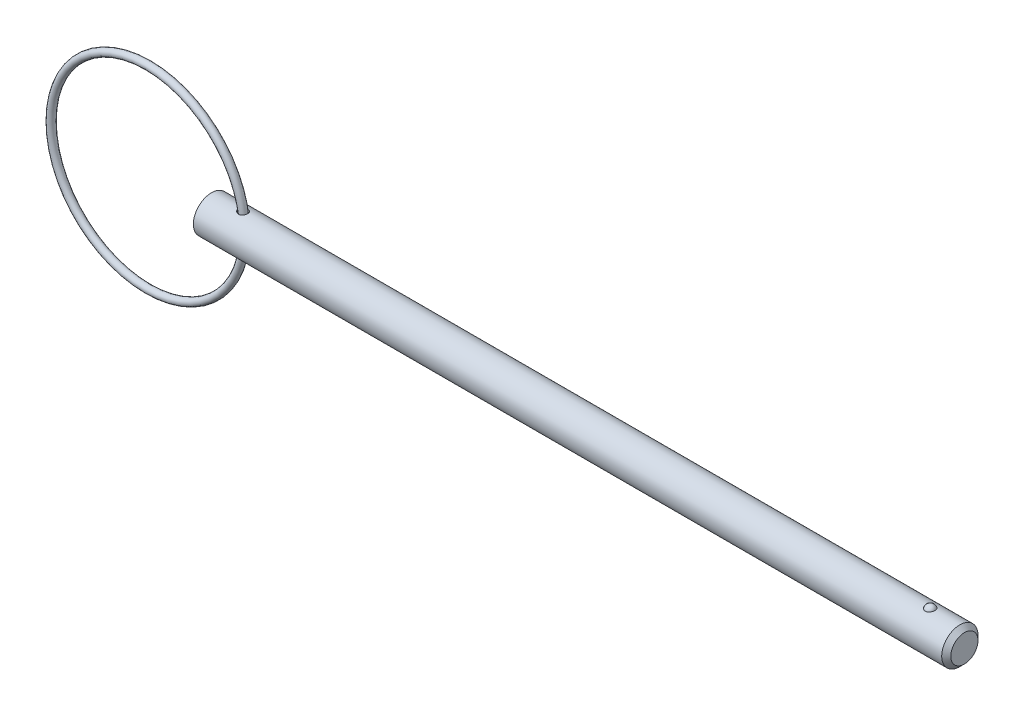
ISO-10303-21;
HEADER;
FILE_DESCRIPTION(('STEP AP214'),'2;1');
FILE_NAME('part.step','',(''),(''),'','','');
FILE_SCHEMA(('AUTOMOTIVE_DESIGN { 1 0 10303 214 1 1 1 1 }'));
ENDSEC;
DATA;
#1=APPLICATION_CONTEXT('core data for automotive mechanical design processes');
#2=APPLICATION_PROTOCOL_DEFINITION('international standard','automotive_design',2000,#1);
#3=PRODUCT_CONTEXT('',#1,'mechanical');
#4=PRODUCT('Part','Part','',(#3));
#5=PRODUCT_RELATED_PRODUCT_CATEGORY('part','',(#4));
#6=PRODUCT_DEFINITION_FORMATION('','',#4);
#7=PRODUCT_DEFINITION_CONTEXT('part definition',#1,'design');
#8=PRODUCT_DEFINITION('design','',#6,#7);
#9=PRODUCT_DEFINITION_SHAPE('','',#8);
#10=(LENGTH_UNIT() NAMED_UNIT(*) SI_UNIT(.MILLI.,.METRE.));
#11=(NAMED_UNIT(*) PLANE_ANGLE_UNIT() SI_UNIT($,.RADIAN.));
#12=(NAMED_UNIT(*) SI_UNIT($,.STERADIAN.) SOLID_ANGLE_UNIT());
#13=UNCERTAINTY_MEASURE_WITH_UNIT(LENGTH_MEASURE(1.E-05),#10,'distance_accuracy_value','');
#14=(GEOMETRIC_REPRESENTATION_CONTEXT(3) GLOBAL_UNCERTAINTY_ASSIGNED_CONTEXT((#13)) GLOBAL_UNIT_ASSIGNED_CONTEXT((#10,
#11,#12)) REPRESENTATION_CONTEXT('',''));
#15=CARTESIAN_POINT('',(0.,0.,0.));
#16=DIRECTION('',(0.,0.,1.));
#17=DIRECTION('',(1.,0.,0.));
#18=AXIS2_PLACEMENT_3D('',#15,#16,#17);
#19=CARTESIAN_POINT('',(-8.3302379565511,0.,0.));
#20=DIRECTION('',(0.,0.,1.));
#21=DIRECTION('',(1.,0.,0.));
#22=AXIS2_PLACEMENT_3D('',#19,#20,#21);
#23=TOROIDAL_SURFACE('',#22,12.7,0.476000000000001);
#24=CARTESIAN_POINT('',(4.8457620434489,0.,0.));
#25=VERTEX_POINT('',#24);
#26=VERTEX_LOOP('',#25);
#27=FACE_BOUND('',#26,.T.);
#28=ADVANCED_FACE('P0_F12',(#27),#23,.T.);
#29=CLOSED_SHELL('',(#28));
#30=MANIFOLD_SOLID_BREP('P0_B1',#29);
#31=CARTESIAN_POINT('',(0.,0.,0.));
#32=DIRECTION('',(1.,0.,0.));
#33=DIRECTION('',(0.,0.,-1.));
#34=AXIS2_PLACEMENT_3D('',#31,#32,#33);
#35=CYLINDRICAL_SURFACE('',#34,2.38);
#36=CARTESIAN_POINT('',(3.67748265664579,2.35074198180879,-0.372037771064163));
#37=CARTESIAN_POINT('',(3.70046616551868,2.34644965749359,-0.399158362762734));
#38=CARTESIAN_POINT('',(3.72581651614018,2.34199234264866,-0.424274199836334));
#39=CARTESIAN_POINT('',(3.78042747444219,2.33326580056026,-0.469907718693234));
#40=CARTESIAN_POINT('',(3.80969342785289,2.32899684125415,-0.490419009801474));
#41=CARTESIAN_POINT('',(3.87128330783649,2.32114904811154,-0.526312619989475));
#42=CARTESIAN_POINT('',(3.90360537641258,2.31756979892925,-0.541698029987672));
#43=CARTESIAN_POINT('',(3.9704452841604,2.31153734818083,-0.566889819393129));
#44=CARTESIAN_POINT('',(4.00496214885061,2.30908365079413,-0.576698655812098));
#45=CARTESIAN_POINT('',(4.07500735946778,2.30564492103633,-0.590297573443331));
#46=CARTESIAN_POINT('',(4.1105275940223,2.30465036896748,-0.594126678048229));
#47=CARTESIAN_POINT('',(4.18170718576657,2.30426876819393,-0.595606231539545));
#48=CARTESIAN_POINT('',(4.21736649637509,2.30488122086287,-0.593258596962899));
#49=CARTESIAN_POINT('',(4.28577822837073,2.30759475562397,-0.582609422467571));
#50=CARTESIAN_POINT('',(4.31858437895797,2.30961492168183,-0.574631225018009));
#51=CARTESIAN_POINT('',(4.38227060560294,2.31483318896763,-0.553233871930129));
#52=CARTESIAN_POINT('',(4.41315097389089,2.31803111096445,-0.539815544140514));
#53=CARTESIAN_POINT('',(4.47118254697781,2.3251225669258,-0.508384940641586));
#54=CARTESIAN_POINT('',(4.49841743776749,2.32899254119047,-0.490521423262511));
#55=CARTESIAN_POINT('',(4.5494826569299,2.33706025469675,-0.450515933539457));
#56=CARTESIAN_POINT('',(4.57331285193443,2.34125800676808,-0.42837379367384));
#57=CARTESIAN_POINT('',(4.6171621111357,2.34956202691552,-0.380209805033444));
#58=CARTESIAN_POINT('',(4.63714543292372,2.35366715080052,-0.354155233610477));
#59=CARTESIAN_POINT('',(4.67254725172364,2.36130301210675,-0.299034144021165));
#60=CARTESIAN_POINT('',(4.68796545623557,2.36483371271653,-0.26996743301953));
#61=CARTESIAN_POINT('',(4.71403776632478,2.37098548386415,-0.209215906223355));
#62=CARTESIAN_POINT('',(4.72462580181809,2.37359383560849,-0.177501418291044));
#63=CARTESIAN_POINT('',(4.74046966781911,2.37755210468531,-0.112692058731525));
#64=CARTESIAN_POINT('',(4.74572552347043,2.37890202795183,-0.0795971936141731));
#65=CARTESIAN_POINT('',(4.75077448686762,2.38019811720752,-0.0129544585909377));
#66=CARTESIAN_POINT('',(4.75056573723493,2.38014380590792,0.0205935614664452));
#67=CARTESIAN_POINT('',(4.74468604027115,2.37863606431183,0.0871753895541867));
#68=CARTESIAN_POINT('',(4.73901506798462,2.37718262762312,0.120209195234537));
#69=CARTESIAN_POINT('',(4.72236472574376,2.37303648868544,0.184779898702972));
#70=CARTESIAN_POINT('',(4.71139268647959,2.37034549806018,0.216318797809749));
#71=CARTESIAN_POINT('',(4.68441400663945,2.36401552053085,0.277063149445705));
#72=CARTESIAN_POINT('',(4.66840715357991,2.36037649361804,0.306268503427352));
#73=CARTESIAN_POINT('',(4.63170627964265,2.35253749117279,0.361595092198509));
#74=CARTESIAN_POINT('',(4.61100040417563,2.34833610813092,0.387708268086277));
#75=CARTESIAN_POINT('',(4.56544852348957,2.33984863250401,0.436017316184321));
#76=CARTESIAN_POINT('',(4.54060272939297,2.33556254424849,0.458213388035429));
#77=CARTESIAN_POINT('',(4.48760111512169,2.32742099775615,0.497916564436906));
#78=CARTESIAN_POINT('',(4.45946763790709,2.32356294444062,0.515452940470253));
#79=CARTESIAN_POINT('',(4.40055109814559,2.31668866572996,0.545520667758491));
#80=CARTESIAN_POINT('',(4.3697684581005,2.31367230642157,0.558052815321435));
#81=CARTESIAN_POINT('',(4.30694930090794,2.30886128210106,0.577633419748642));
#82=CARTESIAN_POINT('',(4.27493988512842,2.30704826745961,0.584764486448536));
#83=CARTESIAN_POINT('',(4.21014558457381,2.30475365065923,0.593744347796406));
#84=CARTESIAN_POINT('',(4.17736068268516,2.30427207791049,0.595593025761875));
#85=CARTESIAN_POINT('',(4.11170515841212,2.30466513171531,0.59406986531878));
#86=CARTESIAN_POINT('',(4.07883545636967,2.30554895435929,0.5906626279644));
#87=CARTESIAN_POINT('',(4.01408593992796,2.30856010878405,0.578780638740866));
#88=CARTESIAN_POINT('',(3.98220636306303,2.31068773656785,0.570304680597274));
#89=CARTESIAN_POINT('',(3.91877258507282,2.31605973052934,0.548090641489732));
#90=CARTESIAN_POINT('',(3.88730095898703,2.31935100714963,0.534128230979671));
#91=CARTESIAN_POINT('',(3.82705133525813,2.32664713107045,0.501391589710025));
#92=CARTESIAN_POINT('',(3.79827429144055,2.33065222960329,0.482615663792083));
#93=CARTESIAN_POINT('',(3.7429634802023,2.3391254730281,0.4397600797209));
#94=CARTESIAN_POINT('',(3.71658313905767,2.3436062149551,0.415484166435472));
#95=CARTESIAN_POINT('',(3.66839516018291,2.35235146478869,0.362706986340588));
#96=CARTESIAN_POINT('',(3.64658727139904,2.35661598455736,0.334205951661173));
#97=CARTESIAN_POINT('',(3.60882605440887,2.36432007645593,0.27436882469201));
#98=CARTESIAN_POINT('',(3.59274982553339,2.36777633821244,0.243112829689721));
#99=CARTESIAN_POINT('',(3.56652169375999,2.3735493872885,0.178112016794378));
#100=CARTESIAN_POINT('',(3.5563653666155,2.3758670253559,0.144369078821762));
#101=CARTESIAN_POINT('',(3.54309691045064,2.37891982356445,0.0783638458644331));
#102=CARTESIAN_POINT('',(3.53947205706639,2.37976992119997,0.0462095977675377));
#103=CARTESIAN_POINT('',(3.53785288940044,2.38014795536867,-0.0182487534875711));
#104=CARTESIAN_POINT('',(3.5398575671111,2.37967612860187,-0.0505528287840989));
#105=CARTESIAN_POINT('',(3.54913867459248,2.37752661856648,-0.112617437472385));
#106=CARTESIAN_POINT('',(3.5561353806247,2.37591295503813,-0.142422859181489));
#107=CARTESIAN_POINT('',(3.5747775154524,2.37172196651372,-0.200451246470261));
#108=CARTESIAN_POINT('',(3.58642049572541,2.36914514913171,-0.228675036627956));
#109=CARTESIAN_POINT('',(3.61071901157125,2.36396321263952,-0.276620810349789));
#110=CARTESIAN_POINT('',(3.62251818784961,2.36150235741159,-0.296799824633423));
#111=CARTESIAN_POINT('',(3.64836661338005,2.35629864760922,-0.335619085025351));
#112=CARTESIAN_POINT('',(3.66241608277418,2.353555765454,-0.354259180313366));
#113=CARTESIAN_POINT('',(3.67748265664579,2.35074198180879,-0.372037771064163));
#114=B_SPLINE_CURVE_WITH_KNOTS('',3,(#36,#37,#38,#39,#40,#41,#42,#43,#44,#45,#46,#47,#48,#49,
#50,#51,#52,#53,#54,#55,#56,#57,#58,#59,#60,#61,#62,#63,#64,#65,#66,#67,#68,#69,#70,#71,#72,#73,
#74,#75,#76,#77,#78,#79,#80,#81,#82,#83,#84,#85,#86,#87,#88,#89,#90,#91,#92,#93,#94,#95,#96,#97,
#98,#99,#100,#101,#102,#103,#104,#105,#106,#107,#108,#109,#110,#111,#112,#113),.UNSPECIFIED.,
.T.,.F.,(4,2,2,2,2,2,2,2,2,2,2,2,2,2,2,2,2,2,2,2,2,2,2,2,2,2,2,2,2,2,2,2,2,2,2,2,2,2,4),(0.,
0.107335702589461,0.214819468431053,0.322238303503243,0.429609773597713,0.536277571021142,
0.642912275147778,0.743874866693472,0.844822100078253,0.942762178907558,1.04070609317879,
1.13952022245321,1.23834068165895,1.33847507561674,1.43860899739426,1.53877695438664,
1.63894536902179,1.7389756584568,1.83901017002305,1.93929990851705,2.03958453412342,
2.13922343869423,2.23884648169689,2.33691317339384,2.43498203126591,2.53371427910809,
2.63247003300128,2.73577311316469,2.83911262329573,2.94697761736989,3.05483668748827,
3.16021984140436,3.2655241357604,3.36212700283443,3.45871257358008,3.55027266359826,
3.64178456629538,3.71214035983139,3.78250304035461),.UNSPECIFIED.);
#115=CARTESIAN_POINT('',(3.67748265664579,2.35074198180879,-0.372037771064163));
#116=VERTEX_POINT('',#115);
#117=EDGE_CURVE('P1_E40',#116,#116,#114,.T.);
#118=ORIENTED_EDGE('',*,*,#117,.T.);
#119=EDGE_LOOP('',(#118));
#120=FACE_BOUND('',#119,.T.);
#121=CARTESIAN_POINT('',(98.135,0.,0.));
#122=DIRECTION('',(1.,0.,0.));
#123=DIRECTION('',(0.,0.,-1.));
#124=AXIS2_PLACEMENT_3D('',#121,#122,#123);
#125=CIRCLE('',#124,2.38);
#126=CARTESIAN_POINT('',(98.135,0.,-2.38));
#127=VERTEX_POINT('',#126);
#128=EDGE_CURVE('P1_E25',#127,#127,#125,.T.);
#129=ORIENTED_EDGE('',*,*,#128,.F.);
#130=EDGE_LOOP('',(#129));
#131=FACE_BOUND('',#130,.T.);
#132=CARTESIAN_POINT('',(0.,0.,0.));
#133=DIRECTION('',(1.,0.,0.));
#134=DIRECTION('',(0.,0.,-1.));
#135=AXIS2_PLACEMENT_3D('',#132,#133,#134);
#136=CIRCLE('',#135,2.38);
#137=CARTESIAN_POINT('',(0.,0.,-2.38));
#138=VERTEX_POINT('',#137);
#139=EDGE_CURVE('P1_E9',#138,#138,#136,.T.);
#140=ORIENTED_EDGE('',*,*,#139,.T.);
#141=EDGE_LOOP('',(#140));
#142=FACE_BOUND('',#141,.T.);
#143=CARTESIAN_POINT('',(94.2634492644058,2.2921568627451,0.640637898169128));
#144=CARTESIAN_POINT('',(94.2303559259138,2.29215737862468,0.640637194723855));
#145=CARTESIAN_POINT('',(94.1972546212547,2.29293179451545,0.637884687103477));
#146=CARTESIAN_POINT('',(94.1320176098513,2.29594030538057,0.626968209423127));
#147=CARTESIAN_POINT('',(94.0998823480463,2.29817506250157,0.618801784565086));
#148=CARTESIAN_POINT('',(94.0375402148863,2.30384308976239,0.597351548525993));
#149=CARTESIAN_POINT('',(94.0073305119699,2.30727454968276,0.584075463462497));
#150=CARTESIAN_POINT('',(93.9495674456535,2.31495941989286,0.55282960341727));
#151=CARTESIAN_POINT('',(93.9220141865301,2.31921286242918,0.53485964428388));
#152=CARTESIAN_POINT('',(93.8695938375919,2.32820213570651,0.494282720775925));
#153=CARTESIAN_POINT('',(93.8448050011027,2.33294694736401,0.471576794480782));
#154=CARTESIAN_POINT('',(93.7992169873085,2.34234144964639,0.422446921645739));
#155=CARTESIAN_POINT('',(93.7784185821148,2.34699112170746,0.396022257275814));
#156=CARTESIAN_POINT('',(93.7403580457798,2.3559394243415,0.338855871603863));
#157=CARTESIAN_POINT('',(93.7233051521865,2.36021170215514,0.307970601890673));
#158=CARTESIAN_POINT('',(93.6943607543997,2.3677057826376,0.243750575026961));
#159=CARTESIAN_POINT('',(93.6824701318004,2.37092740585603,0.210415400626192));
#160=CARTESIAN_POINT('',(93.6638076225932,2.37606901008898,0.141189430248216));
#161=CARTESIAN_POINT('',(93.6571956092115,2.37794816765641,0.105252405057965));
#162=CARTESIAN_POINT('',(93.6498095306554,2.38005135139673,0.0327351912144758));
#163=CARTESIAN_POINT('',(93.6490358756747,2.38027526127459,-0.00384504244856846));
#164=CARTESIAN_POINT('',(93.6533628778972,2.37903842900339,-0.0769838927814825));
#165=CARTESIAN_POINT('',(93.6585202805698,2.37756141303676,-0.113538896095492));
#166=CARTESIAN_POINT('',(93.6747013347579,2.37305303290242,-0.185229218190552));
#167=CARTESIAN_POINT('',(93.6857251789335,2.37002161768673,-0.220364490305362));
#168=CARTESIAN_POINT('',(93.7133977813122,2.36273722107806,-0.288156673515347));
#169=CARTESIAN_POINT('',(93.7300389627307,2.35848588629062,-0.320816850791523));
#170=CARTESIAN_POINT('',(93.7685984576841,2.34923130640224,-0.382744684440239));
#171=CARTESIAN_POINT('',(93.790516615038,2.34422808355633,-0.412012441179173));
#172=CARTESIAN_POINT('',(93.8387549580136,2.33412555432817,-0.465830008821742));
#173=CARTESIAN_POINT('',(93.8650028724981,2.32902887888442,-0.490444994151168));
#174=CARTESIAN_POINT('',(93.9214769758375,2.31926941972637,-0.5347003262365));
#175=CARTESIAN_POINT('',(93.951702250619,2.3146065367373,-0.554341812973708));
#176=CARTESIAN_POINT('',(94.0140618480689,2.30645675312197,-0.587312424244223));
#177=CARTESIAN_POINT('',(94.0460780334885,2.30293152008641,-0.600855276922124));
#178=CARTESIAN_POINT('',(94.1120795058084,2.29725171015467,-0.62222045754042));
#179=CARTESIAN_POINT('',(94.1460641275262,2.29509667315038,-0.63004470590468));
#180=CARTESIAN_POINT('',(94.213299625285,2.29249264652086,-0.639452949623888));
#181=CARTESIAN_POINT('',(94.2465087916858,2.29196755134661,-0.641315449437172));
#182=CARTESIAN_POINT('',(94.312763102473,2.29246849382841,-0.639522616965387));
#183=CARTESIAN_POINT('',(94.3458082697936,2.29349430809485,-0.635868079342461));
#184=CARTESIAN_POINT('',(94.4101025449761,2.29694059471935,-0.623301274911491));
#185=CARTESIAN_POINT('',(94.4413744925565,2.29933234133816,-0.61449721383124));
#186=CARTESIAN_POINT('',(94.5019952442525,2.30522511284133,-0.59200626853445));
#187=CARTESIAN_POINT('',(94.5313438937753,2.30872622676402,-0.578318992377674));
#188=CARTESIAN_POINT('',(94.5880369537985,2.31655795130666,-0.546112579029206));
#189=CARTESIAN_POINT('',(94.615320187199,2.32090569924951,-0.527490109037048));
#190=CARTESIAN_POINT('',(94.6664904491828,2.32992206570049,-0.48611785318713));
#191=CARTESIAN_POINT('',(94.6903767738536,2.33459075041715,-0.46336721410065));
#192=CARTESIAN_POINT('',(94.7352722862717,2.34399834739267,-0.413220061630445));
#193=CARTESIAN_POINT('',(94.7560972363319,2.34873051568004,-0.385657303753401));
#194=CARTESIAN_POINT('',(94.793056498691,2.35754932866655,-0.327455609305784));
#195=CARTESIAN_POINT('',(94.8091898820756,2.36163584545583,-0.296816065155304));
#196=CARTESIAN_POINT('',(94.8369822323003,2.36889321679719,-0.232047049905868));
#197=CARTESIAN_POINT('',(94.8484450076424,2.37202275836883,-0.197828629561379));
#198=CARTESIAN_POINT('',(94.8657523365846,2.37681926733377,-0.127900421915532));
#199=CARTESIAN_POINT('',(94.8715962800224,2.37848607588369,-0.0921904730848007));
#200=CARTESIAN_POINT('',(94.877605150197,2.38020024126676,-0.0196348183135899));
#201=CARTESIAN_POINT('',(94.8776704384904,2.38021918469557,0.0172198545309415));
#202=CARTESIAN_POINT('',(94.8718689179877,2.37856356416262,0.0904219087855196));
#203=CARTESIAN_POINT('',(94.8660018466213,2.37688892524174,0.126769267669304));
#204=CARTESIAN_POINT('',(94.848425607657,2.37201688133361,0.198028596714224));
#205=CARTESIAN_POINT('',(94.836699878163,2.36881516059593,0.232936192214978));
#206=CARTESIAN_POINT('',(94.8076354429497,2.36123444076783,0.300196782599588));
#207=CARTESIAN_POINT('',(94.7902967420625,2.3568554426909,0.332549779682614));
#208=CARTESIAN_POINT('',(94.7505350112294,2.34744667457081,0.393495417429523));
#209=CARTESIAN_POINT('',(94.7281528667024,2.34242227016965,0.422115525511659));
#210=CARTESIAN_POINT('',(94.6787391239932,2.33227293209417,0.475004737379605));
#211=CARTESIAN_POINT('',(94.6517076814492,2.32714800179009,0.499273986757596));
#212=CARTESIAN_POINT('',(94.5944988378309,2.31755359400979,0.54204602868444));
#213=CARTESIAN_POINT('',(94.5644297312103,2.3130698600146,0.560690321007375));
#214=CARTESIAN_POINT('',(94.5013869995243,2.3051412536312,0.592447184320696));
#215=CARTESIAN_POINT('',(94.4684158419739,2.30169550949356,0.605564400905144));
#216=CARTESIAN_POINT('',(94.4068424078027,2.29677744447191,0.623927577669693));
#217=CARTESIAN_POINT('',(94.3785555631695,2.29505839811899,0.630178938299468));
#218=CARTESIAN_POINT('',(94.3213308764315,2.29274795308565,0.638534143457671));
#219=CARTESIAN_POINT('',(94.2923931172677,2.29215641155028,0.64063851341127));
#220=CARTESIAN_POINT('',(94.2634492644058,2.2921568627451,0.640637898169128));
#221=B_SPLINE_CURVE_WITH_KNOTS('',3,(#143,#144,#145,#146,#147,#148,#149,#150,#151,#152,#153,
#154,#155,#156,#157,#158,#159,#160,#161,#162,#163,#164,#165,#166,#167,#168,#169,#170,#171,#172,
#173,#174,#175,#176,#177,#178,#179,#180,#181,#182,#183,#184,#185,#186,#187,#188,#189,#190,#191,
#192,#193,#194,#195,#196,#197,#198,#199,#200,#201,#202,#203,#204,#205,#206,#207,#208,#209,#210,
#211,#212,#213,#214,#215,#216,#217,#218,#219,#220),.UNSPECIFIED.,.T.,.F.,(4,2,2,2,2,2,2,2,2,2,2,
2,2,2,2,2,2,2,2,2,2,2,2,2,2,2,2,2,2,2,2,2,2,2,2,2,2,2,4),(0.,0.0991724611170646,
0.198389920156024,0.297457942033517,0.396529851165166,0.497927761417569,0.599345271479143,
0.705475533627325,0.811623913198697,0.920876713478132,1.03013718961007,1.1404517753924,
1.25076998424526,1.3609399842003,1.47110672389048,1.57959248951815,1.6880533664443,
1.79234266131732,1.89659691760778,1.99590391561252,2.0951966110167,2.19247425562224,
2.28975970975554,2.38926978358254,2.48880044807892,2.5929358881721,2.69709193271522,
2.80525821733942,2.91343624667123,3.02347917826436,3.13352698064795,3.24388765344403,
3.35424823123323,3.46374443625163,3.57323697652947,3.67968690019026,3.78604717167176,
3.87279565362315,3.9595331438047),.UNSPECIFIED.);
#222=CARTESIAN_POINT('',(94.2634492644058,2.2921568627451,0.640637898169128));
#223=VERTEX_POINT('',#222);
#224=EDGE_CURVE('P1_E34',#223,#223,#221,.T.);
#225=ORIENTED_EDGE('',*,*,#224,.T.);
#226=EDGE_LOOP('',(#225));
#227=FACE_BOUND('',#226,.T.);
#228=CARTESIAN_POINT('',(3.67748265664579,-2.35074198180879,-0.372037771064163));
#229=CARTESIAN_POINT('',(3.65652023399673,-2.35465684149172,-0.34730037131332));
#230=CARTESIAN_POINT('',(3.63751328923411,-2.35843676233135,-0.320880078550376));
#231=CARTESIAN_POINT('',(3.60404107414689,-2.36534227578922,-0.265218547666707));
#232=CARTESIAN_POINT('',(3.58957485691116,-2.36846800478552,-0.235977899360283));
#233=CARTESIAN_POINT('',(3.56572865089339,-2.37373250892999,-0.17528149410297));
#234=CARTESIAN_POINT('',(3.55636565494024,-2.37586798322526,-0.143818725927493));
#235=CARTESIAN_POINT('',(3.54325775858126,-2.37888184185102,-0.0796854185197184));
#236=CARTESIAN_POINT('',(3.53951093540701,-2.37976065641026,-0.047015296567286));
#237=CARTESIAN_POINT('',(3.53787230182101,-2.38014359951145,0.0167788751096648));
#238=CARTESIAN_POINT('',(3.53968714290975,-2.37971660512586,0.0478953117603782));
#239=CARTESIAN_POINT('',(3.54844977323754,-2.37768530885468,0.10935299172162));
#240=CARTESIAN_POINT('',(3.55539746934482,-2.37608102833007,0.139694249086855));
#241=CARTESIAN_POINT('',(3.57400783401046,-2.37189301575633,0.198451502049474));
#242=CARTESIAN_POINT('',(3.58561918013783,-2.36931996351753,0.226884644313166));
#243=CARTESIAN_POINT('',(3.61310377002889,-2.36345094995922,0.281524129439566));
#244=CARTESIAN_POINT('',(3.62897804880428,-2.36015481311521,0.307729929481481));
#245=CARTESIAN_POINT('',(3.66562367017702,-2.35291979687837,0.359001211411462));
#246=CARTESIAN_POINT('',(3.68664499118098,-2.34895316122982,0.38388386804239));
#247=CARTESIAN_POINT('',(3.73230875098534,-2.34094029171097,0.430056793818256));
#248=CARTESIAN_POINT('',(3.75695270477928,-2.33689402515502,0.451345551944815));
#249=CARTESIAN_POINT('',(3.81128123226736,-2.32880869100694,0.491427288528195));
#250=CARTESIAN_POINT('',(3.84120889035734,-2.32479472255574,0.509896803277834));
#251=CARTESIAN_POINT('',(3.90376464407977,-2.31758417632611,0.541729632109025));
#252=CARTESIAN_POINT('',(3.93639323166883,-2.31438774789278,0.555092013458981));
#253=CARTESIAN_POINT('',(4.00416670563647,-2.30915137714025,0.576493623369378));
#254=CARTESIAN_POINT('',(4.0393485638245,-2.30713552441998,0.584422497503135));
#255=CARTESIAN_POINT('',(4.11060438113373,-2.30465258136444,0.594140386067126));
#256=CARTESIAN_POINT('',(4.14667802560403,-2.30418495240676,0.595931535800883));
#257=CARTESIAN_POINT('',(4.21693481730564,-2.30488473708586,0.593218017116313));
#258=CARTESIAN_POINT('',(4.25112951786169,-2.30597897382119,0.588995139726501));
#259=CARTESIAN_POINT('',(4.31821509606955,-2.30956729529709,0.57476284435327));
#260=CARTESIAN_POINT('',(4.35110629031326,-2.31206103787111,0.564754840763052));
#261=CARTESIAN_POINT('',(4.41316900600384,-2.31802118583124,0.53975368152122));
#262=CARTESIAN_POINT('',(4.44243993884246,-2.32144077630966,0.524995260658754));
#263=CARTESIAN_POINT('',(4.49802365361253,-2.32890801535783,0.49080792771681));
#264=CARTESIAN_POINT('',(4.52433643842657,-2.33295566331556,0.471379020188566));
#265=CARTESIAN_POINT('',(4.57327790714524,-2.3412242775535,0.428422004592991));
#266=CARTESIAN_POINT('',(4.59591094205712,-2.34544503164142,0.404898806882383));
#267=CARTESIAN_POINT('',(4.63697038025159,-2.35360640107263,0.354387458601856));
#268=CARTESIAN_POINT('',(4.65539647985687,-2.35754699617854,0.327399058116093));
#269=CARTESIAN_POINT('',(4.68784943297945,-2.36478461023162,0.270249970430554));
#270=CARTESIAN_POINT('',(4.70180333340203,-2.36807065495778,0.240046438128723));
#271=CARTESIAN_POINT('',(4.72457181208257,-2.3735656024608,0.177668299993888));
#272=CARTESIAN_POINT('',(4.73338630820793,-2.37577448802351,0.145493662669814));
#273=CARTESIAN_POINT('',(4.74568442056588,-2.37888446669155,0.0799353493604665));
#274=CARTESIAN_POINT('',(4.74914498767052,-2.37977990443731,0.0465470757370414));
#275=CARTESIAN_POINT('',(4.7505750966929,-2.38014803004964,-0.0203543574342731));
#276=CARTESIAN_POINT('',(4.74854468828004,-2.37962073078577,-0.0538675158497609));
#277=CARTESIAN_POINT('',(4.73905606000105,-2.37720346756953,-0.119981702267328));
#278=CARTESIAN_POINT('',(4.73161109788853,-2.37531683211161,-0.152584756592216));
#279=CARTESIAN_POINT('',(4.71149336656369,-2.37038779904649,-0.21604453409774));
#280=CARTESIAN_POINT('',(4.69882040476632,-2.36734535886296,-0.246901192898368));
#281=CARTESIAN_POINT('',(4.66852750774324,-2.3604270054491,-0.306062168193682));
#282=CARTESIAN_POINT('',(4.6508974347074,-2.35654938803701,-0.334361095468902));
#283=CARTESIAN_POINT('',(4.61113860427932,-2.34839114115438,-0.387535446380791));
#284=CARTESIAN_POINT('',(4.5890098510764,-2.34411051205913,-0.412410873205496));
#285=CARTESIAN_POINT('',(4.54086484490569,-2.33563475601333,-0.457982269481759));
#286=CARTESIAN_POINT('',(4.51485596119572,-2.33143948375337,-0.478685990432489));
#287=CARTESIAN_POINT('',(4.45962330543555,-2.32360655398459,-0.515369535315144));
#288=CARTESIAN_POINT('',(4.43040000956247,-2.31996881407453,-0.53135005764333));
#289=CARTESIAN_POINT('',(4.37002624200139,-2.31371771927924,-0.557938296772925));
#290=CARTESIAN_POINT('',(4.33891082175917,-2.31108995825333,-0.56862225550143));
#291=CARTESIAN_POINT('',(4.27527207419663,-2.30707117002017,-0.584715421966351));
#292=CARTESIAN_POINT('',(4.24274884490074,-2.30568005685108,-0.590124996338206));
#293=CARTESIAN_POINT('',(4.17738918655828,-2.30427145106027,-0.595601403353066));
#294=CARTESIAN_POINT('',(4.14455499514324,-2.3042474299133,-0.595693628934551));
#295=CARTESIAN_POINT('',(4.07930726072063,-2.30552664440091,-0.590722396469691));
#296=CARTESIAN_POINT('',(4.04689380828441,-2.3068301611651,-0.585657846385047));
#297=CARTESIAN_POINT('',(3.98220150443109,-2.31066076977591,-0.570360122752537));
#298=CARTESIAN_POINT('',(3.94996602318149,-2.31322859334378,-0.559954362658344));
#299=CARTESIAN_POINT('',(3.88760707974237,-2.31930140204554,-0.534242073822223));
#300=CARTESIAN_POINT('',(3.85748403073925,-2.32280656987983,-0.518934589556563));
#301=CARTESIAN_POINT('',(3.80033132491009,-2.33034138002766,-0.483968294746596));
#302=CARTESIAN_POINT('',(3.77327623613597,-2.33436601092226,-0.464349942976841));
#303=CARTESIAN_POINT('',(3.72262060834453,-2.34255524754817,-0.421092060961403));
#304=CARTESIAN_POINT('',(3.69901956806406,-2.34671983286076,-0.397453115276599));
#305=CARTESIAN_POINT('',(3.67748265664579,-2.35074198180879,-0.372037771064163));
#306=B_SPLINE_CURVE_WITH_KNOTS('',3,(#228,#229,#230,#231,#232,#233,#234,#235,#236,#237,#238,
#239,#240,#241,#242,#243,#244,#245,#246,#247,#248,#249,#250,#251,#252,#253,#254,#255,#256,#257,
#258,#259,#260,#261,#262,#263,#264,#265,#266,#267,#268,#269,#270,#271,#272,#273,#274,#275,#276,
#277,#278,#279,#280,#281,#282,#283,#284,#285,#286,#287,#288,#289,#290,#291,#292,#293,#294,#295,
#296,#297,#298,#299,#300,#301,#302,#303,#304,#305),.UNSPECIFIED.,.T.,.F.,(4,2,2,2,2,2,2,2,2,2,2,
2,2,2,2,2,2,2,2,2,2,2,2,2,2,2,2,2,2,2,2,2,2,2,2,2,2,2,4),(0.,0.09787553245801,0.19573064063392,
0.293909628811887,0.39205499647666,0.485114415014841,0.578172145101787,0.670232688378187,
0.762315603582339,0.860342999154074,0.958411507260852,1.06411708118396,1.16984195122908,
1.27765506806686,1.38543067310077,1.48831936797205,1.59118291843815,1.68959047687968,
1.78799793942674,1.88628818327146,1.98458551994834,2.08441314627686,2.18424236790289,
2.28450017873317,2.3847570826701,2.4847693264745,2.58478525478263,2.68500723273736,
2.78522911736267,2.8852630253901,2.98528213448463,3.08381637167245,3.18234375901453,
3.28040059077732,3.37847819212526,3.47994551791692,3.58143263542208,3.68200512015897,
3.78256299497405),.UNSPECIFIED.);
#307=CARTESIAN_POINT('',(3.67748265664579,-2.35074198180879,-0.372037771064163));
#308=VERTEX_POINT('',#307);
#309=EDGE_CURVE('P1_E17',#308,#308,#306,.T.);
#310=ORIENTED_EDGE('',*,*,#309,.T.);
#311=EDGE_LOOP('',(#310));
#312=FACE_BOUND('',#311,.T.);
#313=ADVANCED_FACE('P1_F13',(#120,#131,#142,#227,#312),#35,.T.);
#314=CARTESIAN_POINT('',(0.,0.,0.));
#315=DIRECTION('',(-1.,0.,0.));
#316=DIRECTION('',(0.,0.,1.));
#317=AXIS2_PLACEMENT_3D('',#314,#315,#316);
#318=PLANE('',#317);
#319=ORIENTED_EDGE('',*,*,#139,.F.);
#320=EDGE_LOOP('',(#319));
#321=FACE_BOUND('',#320,.T.);
#322=ADVANCED_FACE('P1_F15',(#321),#318,.T.);
#323=CARTESIAN_POINT('',(98.73,0.,0.));
#324=DIRECTION('',(-1.,0.,0.));
#325=DIRECTION('',(0.,0.,1.));
#326=AXIS2_PLACEMENT_3D('',#323,#324,#325);
#327=CONICAL_SURFACE('',#326,1.78500000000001,0.785398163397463);
#328=ORIENTED_EDGE('',*,*,#128,.T.);
#329=EDGE_LOOP('',(#328));
#330=FACE_BOUND('',#329,.T.);
#331=CARTESIAN_POINT('',(98.73,0.,0.));
#332=DIRECTION('',(1.,0.,0.));
#333=DIRECTION('',(0.,0.,-1.));
#334=AXIS2_PLACEMENT_3D('',#331,#332,#333);
#335=CIRCLE('',#334,1.78500000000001);
#336=CARTESIAN_POINT('',(98.73,0.,-1.78500000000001));
#337=VERTEX_POINT('',#336);
#338=EDGE_CURVE('P1_E30',#337,#337,#335,.T.);
#339=ORIENTED_EDGE('',*,*,#338,.F.);
#340=EDGE_LOOP('',(#339));
#341=FACE_BOUND('',#340,.T.);
#342=ADVANCED_FACE('P1_F55',(#330,#341),#327,.T.);
#343=CARTESIAN_POINT('',(98.73,1.78500000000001,0.));
#344=DIRECTION('',(1.,0.,0.));
#345=DIRECTION('',(0.,0.,-1.));
#346=AXIS2_PLACEMENT_3D('',#343,#344,#345);
#347=PLANE('',#346);
#348=ORIENTED_EDGE('',*,*,#338,.T.);
#349=EDGE_LOOP('',(#348));
#350=FACE_BOUND('',#349,.T.);
#351=ADVANCED_FACE('P1_F51',(#350),#347,.T.);
#352=CARTESIAN_POINT('',(94.2634492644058,2.142,0.));
#353=DIRECTION('',(-1.,0.,0.));
#354=DIRECTION('',(0.,1.,0.));
#355=AXIS2_PLACEMENT_3D('',#352,#353,#354);
#356=SPHERICAL_SURFACE('',#355,0.658000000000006);
#357=ORIENTED_EDGE('',*,*,#224,.F.);
#358=EDGE_LOOP('',(#357));
#359=FACE_BOUND('',#358,.T.);
#360=ADVANCED_FACE('P1_F46',(#359),#356,.T.);
#361=CARTESIAN_POINT('',(-8.33023795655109,0.,0.));
#362=DIRECTION('',(0.,0.,1.));
#363=DIRECTION('',(1.,0.,0.));
#364=AXIS2_PLACEMENT_3D('',#361,#362,#363);
#365=TOROIDAL_SURFACE('',#364,12.7,0.594999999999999);
#366=ORIENTED_EDGE('',*,*,#309,.F.);
#367=EDGE_LOOP('',(#366));
#368=FACE_BOUND('',#367,.T.);
#369=ORIENTED_EDGE('',*,*,#117,.F.);
#370=EDGE_LOOP('',(#369));
#371=FACE_BOUND('',#370,.T.);
#372=ADVANCED_FACE('P1_F50',(#368,#371),#365,.F.);
#373=CLOSED_SHELL('',(#313,#322,#342,#351,#360,#372));
#374=MANIFOLD_SOLID_BREP('P1_B1',#373);
#375=ADVANCED_BREP_SHAPE_REPRESENTATION('',(#18,#30,#374),#14);
#376=SHAPE_DEFINITION_REPRESENTATION(#9,#375);
ENDSEC;
END-ISO-10303-21;
